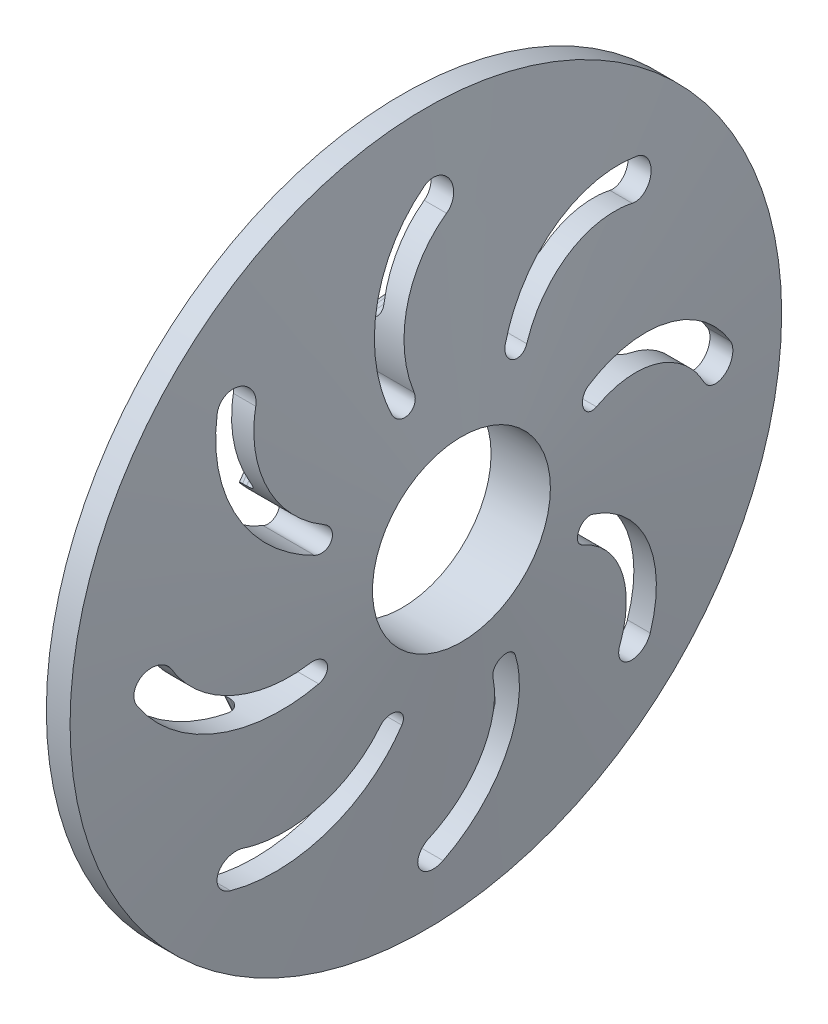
from build123d import *

# Parameters (mm, degrees)
SKETCH1_R           = 76.2
BOSS_EXTRUDE1_DEPTH = 12.7
SKETCH2_R           = 19.05
CUT_EXTRUDE1_DEPTH  = 12.7
SKETCH6_R           = 2.54
CUT_EXTRUDE2_DEPTH  = 6.35
CIRPATTERN1_COUNT   = 4
FILLET1_R           = 2.54
FILLET2_R           = 1.27
CUT_EXTRUDE3_DEPTH  = 109.508847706
CIRPATTERN3_COUNT   = 8


with BuildPart() as part:
    # Sketch1 → Boss-Extrude1 (new body)
    with BuildSketch(Plane(origin=(0, 0, 0), x_dir=(0, 0, -1), z_dir=(1, 0, 0))):
        Circle(SKETCH1_R)
    extrude(amount=BOSS_EXTRUDE1_DEPTH)

    # Sketch2 → Cut-Extrude1 (cut)
    with BuildSketch(Plane(origin=(12.7, 0, 0), x_dir=(0, 0, -1), z_dir=(1, 0, 0))):
        Circle(SKETCH2_R)
    extrude(amount=-CUT_EXTRUDE1_DEPTH, mode=Mode.SUBTRACT)

    # Sketch4 → Cut-Revolve1 (revolve, cut)
    with BuildSketch(Plane.XY, mode=Mode.PRIVATE) as cut_revolve1_sk:
        Polygon((12.7, 76.2), (12.7, 19.05), (5.08, 76.2), align=None)
    revolve(cut_revolve1_sk.sketch.rotate(Axis((12.7, 0, 0), (-1, 0, 0)), 270), axis=Axis((12.7, 0, 0), (-1, 0, 0)), mode=Mode.SUBTRACT)

    # Sketch5 → Cut-Revolve2 (revolve, cut)
    with BuildSketch(Plane.XY, mode=Mode.PRIVATE) as cut_revolve2_sk:
        Polygon((0, 76.2), (5.08, 41.91), (0, 41.91), align=None)
    revolve(cut_revolve2_sk.sketch.rotate(Axis((0, 0, 0), (1, 0, 0)), 90), axis=Axis((0, 0, 0), (1, 0, 0)), mode=Mode.SUBTRACT)

    # Sketch6 → Cut-Extrude2 (cut)
    with BuildSketch(Plane.ZY):
        with Locations((-35.921024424, 0)):
            Circle(SKETCH6_R)
    cut_extrude2 = extrude(amount=-CUT_EXTRUDE2_DEPTH, mode=Mode.SUBTRACT)

    # CirPattern1: Cut-Extrude2 ×4 about axis
    cirpattern1_axis = Axis((0, 0, 0), (1, 0, 0))
    for i in range(1, CIRPATTERN1_COUNT):
        add(cut_extrude2.rotate(cirpattern1_axis, i * 360 / CIRPATTERN1_COUNT), mode=Mode.SUBTRACT)

    # Fillet1
    fillet1_edges = [part.edges().sort_by_distance(p)[0] for p in [
        (5.08, 0, -41.91),
    ]]
    fillet(fillet1_edges, radius=FILLET1_R)

    # Fillet2
    fillet2_edges = [part.edges().sort_by_distance(p)[0] for p in [
        (0, 0, -41.91),
    ]]
    fillet(fillet2_edges, radius=FILLET2_R)

    # Sketch7 → Cut-Extrude3 (cut, through all)
    with BuildSketch(Plane(origin=(0, 0, 0), x_dir=(0, 0, -1), z_dir=(1, 0, 0))):
        with BuildLine():
            ThreePointArc((-13.209299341, 28.871732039), (-13.955338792, 48.262007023), (-2.015389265, 63.558311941))
            ThreePointArc((-2.015389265, 63.558311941), (3.273844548, 62.273856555), (1.881508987, 57.011991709))
            ThreePointArc((1.881508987, 57.011991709), (-7.961526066, 45.640230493), (-8.439481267, 30.607803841))
            ThreePointArc((-8.439481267, 30.607803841), (-9.990408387, 27.448421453), (-13.209299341, 28.871732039))
        make_face()
    cut_extrude3 = extrude(amount=CUT_EXTRUDE3_DEPTH, mode=Mode.SUBTRACT)

    # CirPattern3: Cut-Extrude3 ×8 about axis
    cirpattern3_axis = Axis((0, 0, 0), (1, 0, 0))
    for i in range(1, CIRPATTERN3_COUNT):
        add(cut_extrude3.rotate(cirpattern3_axis, i * 360 / CIRPATTERN3_COUNT), mode=Mode.SUBTRACT)


solid = part.part
